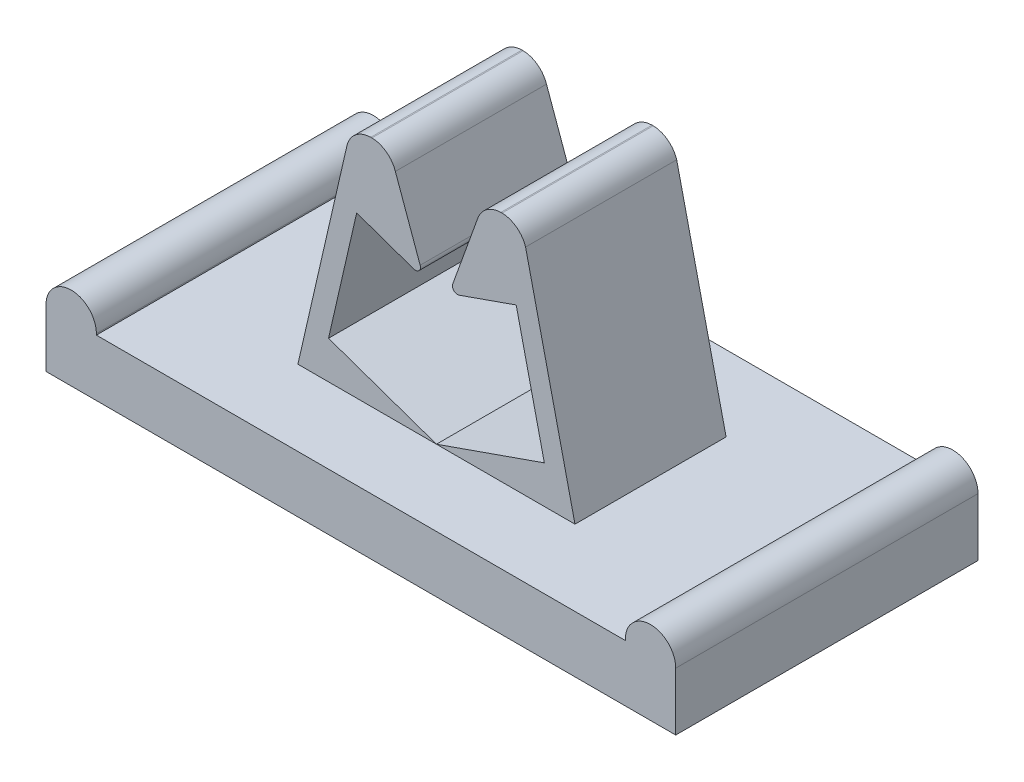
from build123d import *

# Parameters (mm, degrees)
ESQUISSE1_W             = 25
ESQUISSE1_H             = 12
EXTRUSION1_DEPTH        = 11.5
ENL_V_MAT_EXTRU_1_DEPTH = 31.020826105
ESQUISSE3_W             = 3.25680187
ESQUISSE3_H             = 9.54578795
ENL_V_MAT_EXTRU_2_DEPTH = 15


with BuildPart() as part:
    # Esquisse1 → Extrusion1 (new body)
    with BuildSketch(Plane(origin=(0, 0, 0), x_dir=(1, 0, 0), z_dir=(0, 1, 0))):
        with Locations((12.5, 6)):
            Rectangle(ESQUISSE1_W, ESQUISSE1_H)
    extrude(amount=EXTRUSION1_DEPTH)

    # Esquisse2 → Enl_v. mat.-Extru.1 (cut, through all)
    with BuildSketch(Plane.XY):
        with BuildLine():
            Line((23, 2.249999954), (23, 2.3))
            ThreePointArc((23, 2.3), (24, 3.3), (25, 2.3))
            Line((25, 2.3), (25, 11.5))
            Line((25, 11.5), (15.105654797, 11.5))
            ThreePointArc((15.105654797, 11.5), (15.684912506, 11.298974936), (16.038627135, 10.798139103))
            Line((16.038627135, 10.798139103), (18.000000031, 2.249999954))
            Line((18.000000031, 2.249999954), (23, 2.249999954))
        make_face()
        with BuildLine():
            Line((13.146440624, 8.079720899), (14.131066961, 10.812701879))
            ThreePointArc((14.131066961, 10.812701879), (14.486221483, 11.303550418), (15.059348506, 11.5))
            Line((15.059348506, 11.5), (12.5, 11.5))
            Line((12.5, 11.5), (9.940651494, 11.5))
            ThreePointArc((9.940651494, 11.5), (10.513778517, 11.303550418), (10.868933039, 10.812701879))
            Line((10.868933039, 10.812701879), (11.853559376, 8.079720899))
            ThreePointArc((11.853559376, 8.079720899), (11.807372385, 7.871064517), (11.599084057, 7.823245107))
            Line((11.599084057, 7.823245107), (9.33356479, 8.619469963))
            Line((9.33356479, 8.619469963), (8.216263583, 3.75))
            Line((8.216263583, 3.75), (12.5, 2.25))
            Line((12.5, 2.25), (16.783736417, 3.75))
            Line((16.783736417, 3.75), (15.66643521, 8.619469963))
            Line((15.66643521, 8.619469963), (13.400915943, 7.823245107))
            ThreePointArc((13.400915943, 7.823245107), (13.192627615, 7.871064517), (13.146440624, 8.079720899))
        make_face()
        with BuildLine():
            Line((8.961372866, 10.798139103), (6.999999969, 2.249999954))
            Line((6.999999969, 2.249999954), (2, 2.249999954))
            Line((2, 2.249999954), (2, 2.3))
            ThreePointArc((2, 2.3), (1, 3.3), (0, 2.3))
            Line((0, 2.3), (0, 11.5))
            Line((0, 11.5), (9.894345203, 11.5))
            ThreePointArc((9.894345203, 11.5), (9.315087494, 11.298974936), (8.961372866, 10.798139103))
        make_face()
    extrude(amount=-ENL_V_MAT_EXTRU_1_DEPTH, mode=Mode.SUBTRACT)

    # Esquisse3 → Enl_v. mat.-Extru.2 (cut)
    with BuildSketch(Plane.ZY.offset(-5)):
        with Locations((-10.628400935, 7.022893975)):
            Rectangle(ESQUISSE3_W, ESQUISSE3_H)
        with Locations((-1.371599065, 7.022893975)):
            Rectangle(ESQUISSE3_W, ESQUISSE3_H)
    extrude(amount=-ENL_V_MAT_EXTRU_2_DEPTH, mode=Mode.SUBTRACT)


solid = part.part
